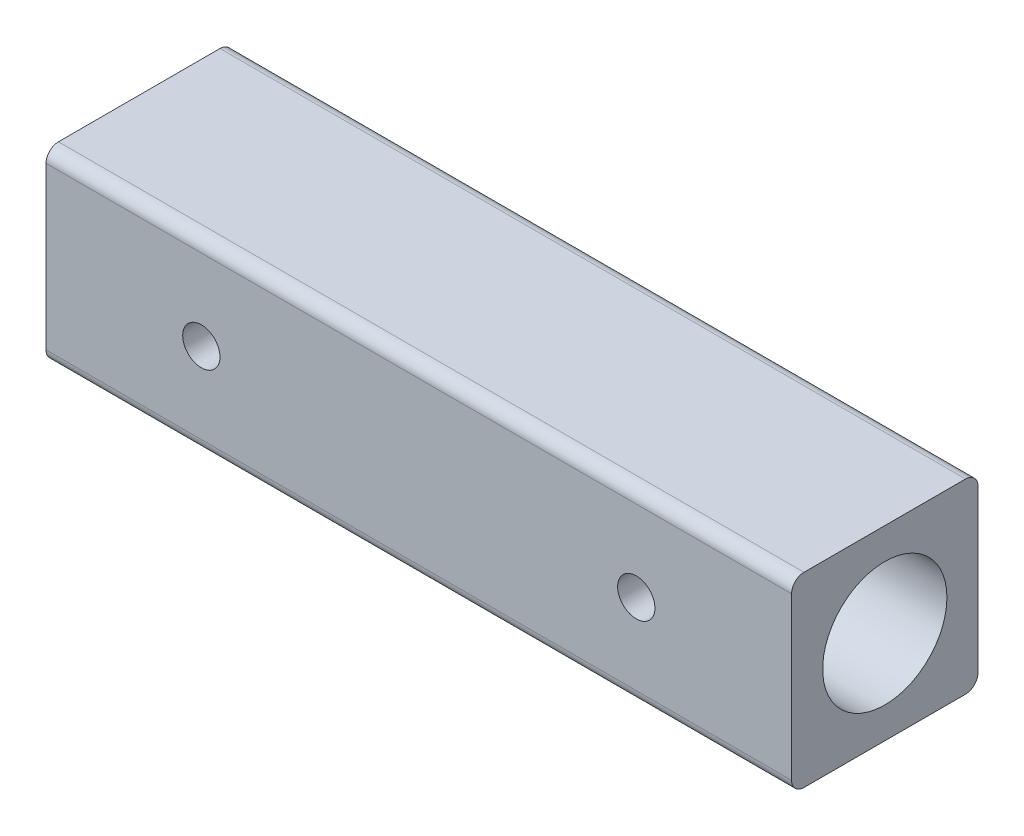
ISO-10303-21;
HEADER;
FILE_DESCRIPTION(('STEP AP214'),'2;1');
FILE_NAME('part.step','',(''),(''),'','','');
FILE_SCHEMA(('AUTOMOTIVE_DESIGN { 1 0 10303 214 1 1 1 1 }'));
ENDSEC;
DATA;
#1=APPLICATION_CONTEXT('core data for automotive mechanical design processes');
#2=APPLICATION_PROTOCOL_DEFINITION('international standard','automotive_design',2000,#1);
#3=PRODUCT_CONTEXT('',#1,'mechanical');
#4=PRODUCT('Part','Part','',(#3));
#5=PRODUCT_RELATED_PRODUCT_CATEGORY('part','',(#4));
#6=PRODUCT_DEFINITION_FORMATION('','',#4);
#7=PRODUCT_DEFINITION_CONTEXT('part definition',#1,'design');
#8=PRODUCT_DEFINITION('design','',#6,#7);
#9=PRODUCT_DEFINITION_SHAPE('','',#8);
#10=(LENGTH_UNIT() NAMED_UNIT(*) SI_UNIT(.MILLI.,.METRE.));
#11=(NAMED_UNIT(*) PLANE_ANGLE_UNIT() SI_UNIT($,.RADIAN.));
#12=(NAMED_UNIT(*) SI_UNIT($,.STERADIAN.) SOLID_ANGLE_UNIT());
#13=UNCERTAINTY_MEASURE_WITH_UNIT(LENGTH_MEASURE(1.E-05),#10,'distance_accuracy_value','');
#14=(GEOMETRIC_REPRESENTATION_CONTEXT(3) GLOBAL_UNCERTAINTY_ASSIGNED_CONTEXT((#13)) GLOBAL_UNIT_ASSIGNED_CONTEXT((#10,
#11,#12)) REPRESENTATION_CONTEXT('',''));
#15=CARTESIAN_POINT('',(0.,0.,0.));
#16=DIRECTION('',(0.,0.,1.));
#17=DIRECTION('',(1.,0.,0.));
#18=AXIS2_PLACEMENT_3D('',#15,#16,#17);
#19=CARTESIAN_POINT('',(40.,0.,0.));
#20=DIRECTION('',(-1.,0.,0.));
#21=DIRECTION('',(0.,0.,1.));
#22=AXIS2_PLACEMENT_3D('',#19,#20,#21);
#23=CYLINDRICAL_SURFACE('',#22,10.);
#24=CARTESIAN_POINT('',(28.,0.,-10.));
#25=CARTESIAN_POINT('',(27.9999980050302,-0.164577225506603,-9.99999858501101));
#26=CARTESIAN_POINT('',(27.9864122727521,-0.329174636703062,-9.99589831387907));
#27=CARTESIAN_POINT('',(27.9325572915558,-0.653576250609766,-9.97994211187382));
#28=CARTESIAN_POINT('',(27.8922800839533,-0.813379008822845,-9.96808386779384));
#29=CARTESIAN_POINT('',(27.7865079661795,-1.12346541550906,-9.93791105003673));
#30=CARTESIAN_POINT('',(27.7210502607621,-1.27376272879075,-9.91960600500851));
#31=CARTESIAN_POINT('',(27.5669278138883,-1.56124836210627,-9.8784421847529));
#32=CARTESIAN_POINT('',(27.4782599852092,-1.69843493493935,-9.85558280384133));
#33=CARTESIAN_POINT('',(27.2775519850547,-1.9597435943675,-9.80701474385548));
#34=CARTESIAN_POINT('',(27.1649667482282,-2.08343614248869,-9.78124767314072));
#35=CARTESIAN_POINT('',(26.9207815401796,-2.31049841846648,-9.73011668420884));
#36=CARTESIAN_POINT('',(26.7891783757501,-2.41386472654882,-9.70475283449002));
#37=CARTESIAN_POINT('',(26.5070584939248,-2.59960075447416,-9.65668227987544));
#38=CARTESIAN_POINT('',(26.3561830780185,-2.68144618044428,-9.63404813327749));
#39=CARTESIAN_POINT('',(26.0420214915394,-2.81842789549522,-9.59487240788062));
#40=CARTESIAN_POINT('',(25.878738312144,-2.87357059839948,-9.57832936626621));
#41=CARTESIAN_POINT('',(25.5492194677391,-2.95403267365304,-9.55381741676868));
#42=CARTESIAN_POINT('',(25.3831945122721,-2.98014392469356,-9.54562138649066));
#43=CARTESIAN_POINT('',(25.0489336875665,-3.00427461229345,-9.53805579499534));
#44=CARTESIAN_POINT('',(24.8806983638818,-3.00230085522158,-9.53868409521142));
#45=CARTESIAN_POINT('',(24.553232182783,-2.97093954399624,-9.54849488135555));
#46=CARTESIAN_POINT('',(24.3938954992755,-2.94254410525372,-9.55736777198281));
#47=CARTESIAN_POINT('',(24.0823604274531,-2.86074840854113,-9.58216712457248));
#48=CARTESIAN_POINT('',(23.9301627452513,-2.80734568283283,-9.59809428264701));
#49=CARTESIAN_POINT('',(23.6347993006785,-2.67632053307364,-9.63545466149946));
#50=CARTESIAN_POINT('',(23.4917858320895,-2.59837633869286,-9.65696032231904));
#51=CARTESIAN_POINT('',(23.2205359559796,-2.42070445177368,-9.70301974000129));
#52=CARTESIAN_POINT('',(23.0923031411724,-2.32097148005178,-9.72757423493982));
#53=CARTESIAN_POINT('',(22.848627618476,-2.09762581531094,-9.77822022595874));
#54=CARTESIAN_POINT('',(22.7339426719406,-1.97318981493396,-9.80433308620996));
#55=CARTESIAN_POINT('',(22.5268920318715,-1.70652651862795,-9.85424488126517));
#56=CARTESIAN_POINT('',(22.4345277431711,-1.56429810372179,-9.8780436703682));
#57=CARTESIAN_POINT('',(22.2742801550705,-1.26471007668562,-9.92086320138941));
#58=CARTESIAN_POINT('',(22.2065649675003,-1.10725549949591,-9.93985087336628));
#59=CARTESIAN_POINT('',(22.0988008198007,-0.782490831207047,-9.97067043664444));
#60=CARTESIAN_POINT('',(22.058744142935,-0.615183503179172,-9.98250432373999));
#61=CARTESIAN_POINT('',(22.0086956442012,-0.281904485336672,-9.99736729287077));
#62=CARTESIAN_POINT('',(21.9976768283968,-0.116100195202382,-10.0006970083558));
#63=CARTESIAN_POINT('',(22.0031383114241,0.21499921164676,-9.99905846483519));
#64=CARTESIAN_POINT('',(22.0196149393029,0.380294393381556,-9.99409131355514));
#65=CARTESIAN_POINT('',(22.078769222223,0.701807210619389,-9.97661393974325));
#66=CARTESIAN_POINT('',(22.1208467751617,0.858145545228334,-9.96427659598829));
#67=CARTESIAN_POINT('',(22.2292864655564,1.16150927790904,-9.9334869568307));
#68=CARTESIAN_POINT('',(22.2956515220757,1.30853355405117,-9.91503392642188));
#69=CARTESIAN_POINT('',(22.4525063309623,1.5928743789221,-9.87339308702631));
#70=CARTESIAN_POINT('',(22.5435186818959,1.72988765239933,-9.8501056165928));
#71=CARTESIAN_POINT('',(22.7464495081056,1.98704661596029,-9.80146937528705));
#72=CARTESIAN_POINT('',(22.8583732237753,2.10718806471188,-9.7761200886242));
#73=CARTESIAN_POINT('',(23.1047746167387,2.33171489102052,-9.72506343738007));
#74=CARTESIAN_POINT('',(23.2399237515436,2.43536962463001,-9.69937650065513));
#75=CARTESIAN_POINT('',(23.5262558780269,2.61857990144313,-9.65153030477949));
#76=CARTESIAN_POINT('',(23.6774384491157,2.69813607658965,-9.62937095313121));
#77=CARTESIAN_POINT('',(23.99106498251,2.83034694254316,-9.5913437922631));
#78=CARTESIAN_POINT('',(24.1534523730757,2.88312693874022,-9.575446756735));
#79=CARTESIAN_POINT('',(24.4853759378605,2.96043461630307,-9.55183188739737));
#80=CARTESIAN_POINT('',(24.6549096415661,2.98497197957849,-9.54411125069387));
#81=CARTESIAN_POINT('',(24.9887230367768,3.0044396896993,-9.53799944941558));
#82=CARTESIAN_POINT('',(25.1529273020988,3.00056110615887,-9.53923294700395));
#83=CARTESIAN_POINT('',(25.4782282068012,2.96615010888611,-9.54998802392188));
#84=CARTESIAN_POINT('',(25.639324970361,2.93561876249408,-9.55950927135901));
#85=CARTESIAN_POINT('',(25.9518907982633,2.84953777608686,-9.58551527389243));
#86=CARTESIAN_POINT('',(26.1034545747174,2.79430351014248,-9.60191209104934));
#87=CARTESIAN_POINT('',(26.3952848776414,2.66063014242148,-9.63980557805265));
#88=CARTESIAN_POINT('',(26.5355492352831,2.58218659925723,-9.6613032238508));
#89=CARTESIAN_POINT('',(26.8063262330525,2.40097527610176,-9.70795352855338));
#90=CARTESIAN_POINT('',(26.9362975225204,2.29742552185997,-9.7332108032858));
#91=CARTESIAN_POINT('',(27.1774049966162,2.07034869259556,-9.78402640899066));
#92=CARTESIAN_POINT('',(27.2885362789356,1.94681643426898,-9.80958481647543));
#93=CARTESIAN_POINT('',(27.4920468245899,1.67893152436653,-9.85901873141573));
#94=CARTESIAN_POINT('',(27.5837828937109,1.53407577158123,-9.88282319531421));
#95=CARTESIAN_POINT('',(27.7414703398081,1.23028274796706,-9.92521360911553));
#96=CARTESIAN_POINT('',(27.807433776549,1.07135210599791,-9.94380199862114));
#97=CARTESIAN_POINT('',(27.9057905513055,0.761515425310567,-9.97204349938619));
#98=CARTESIAN_POINT('',(27.9410233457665,0.611573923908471,-9.9824405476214));
#99=CARTESIAN_POINT('',(27.9881270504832,0.307760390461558,-9.9964188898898));
#100=CARTESIAN_POINT('',(28.0000018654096,0.153889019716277,-10.0000013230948));
#101=CARTESIAN_POINT('',(28.,0.,-10.));
#102=B_SPLINE_CURVE_WITH_KNOTS('',3,(#24,#25,#26,#27,#28,#29,#30,#31,#32,#33,#34,#35,#36,#37,
#38,#39,#40,#41,#42,#43,#44,#45,#46,#47,#48,#49,#50,#51,#52,#53,#54,#55,#56,#57,#58,#59,#60,#61,
#62,#63,#64,#65,#66,#67,#68,#69,#70,#71,#72,#73,#74,#75,#76,#77,#78,#79,#80,#81,#82,#83,#84,#85,
#86,#87,#88,#89,#90,#91,#92,#93,#94,#95,#96,#97,#98,#99,#100,#101),.UNSPECIFIED.,.T.,.F.,(4,2,2,
2,2,2,2,2,2,2,2,2,2,2,2,2,2,2,2,2,2,2,2,2,2,2,2,2,2,2,2,2,2,2,2,2,2,2,4),(0.,0.493166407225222,
0.986479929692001,1.47906735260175,1.97172032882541,2.47711205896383,2.98258874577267,
3.49942962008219,4.01614629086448,4.51839378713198,5.02051956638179,5.50452033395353,
5.98856887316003,6.4792485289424,6.97004720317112,7.48134208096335,7.99266913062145,
8.50742093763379,9.02202907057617,9.51817618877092,10.0142570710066,10.4991349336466,
10.9840710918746,11.4802261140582,11.9765056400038,12.4908080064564,13.0050968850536,
13.5169562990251,14.0286401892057,14.5190031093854,15.0093463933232,15.4936008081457,
15.9779479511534,16.4799385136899,16.9820594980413,17.4988599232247,18.0154182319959,
18.4766338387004,18.9377723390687),.UNSPECIFIED.);
#103=CARTESIAN_POINT('',(28.,0.,-10.));
#104=VERTEX_POINT('',#103);
#105=EDGE_CURVE('E187',#104,#104,#102,.T.);
#106=ORIENTED_EDGE('',*,*,#105,.T.);
#107=EDGE_LOOP('',(#106));
#108=FACE_BOUND('',#107,.T.);
#109=CARTESIAN_POINT('',(40.,0.,0.));
#110=DIRECTION('',(1.,0.,0.));
#111=DIRECTION('',(0.,0.,-1.));
#112=AXIS2_PLACEMENT_3D('',#109,#110,#111);
#113=CIRCLE('',#112,10.);
#114=CARTESIAN_POINT('',(40.,0.,-10.));
#115=VERTEX_POINT('',#114);
#116=EDGE_CURVE('E152',#115,#115,#113,.T.);
#117=ORIENTED_EDGE('',*,*,#116,.T.);
#118=EDGE_LOOP('',(#117));
#119=FACE_BOUND('',#118,.T.);
#120=CARTESIAN_POINT('',(0.,0.,0.));
#121=DIRECTION('',(1.,0.,0.));
#122=DIRECTION('',(0.,0.,-1.));
#123=AXIS2_PLACEMENT_3D('',#120,#121,#122);
#124=CIRCLE('',#123,10.);
#125=CARTESIAN_POINT('',(0.,0.,-10.));
#126=VERTEX_POINT('',#125);
#127=EDGE_CURVE('E194',#126,#126,#124,.T.);
#128=ORIENTED_EDGE('',*,*,#127,.F.);
#129=EDGE_LOOP('',(#128));
#130=FACE_BOUND('',#129,.T.);
#131=CARTESIAN_POINT('',(28.,0.,10.));
#132=CARTESIAN_POINT('',(27.9999980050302,0.1645772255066,9.99999858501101));
#133=CARTESIAN_POINT('',(27.9864122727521,0.32917463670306,9.99589831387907));
#134=CARTESIAN_POINT('',(27.9325572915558,0.653576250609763,9.97994211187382));
#135=CARTESIAN_POINT('',(27.8922800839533,0.813379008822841,9.96808386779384));
#136=CARTESIAN_POINT('',(27.7865079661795,1.12346541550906,9.93791105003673));
#137=CARTESIAN_POINT('',(27.7210502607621,1.27376272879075,9.91960600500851));
#138=CARTESIAN_POINT('',(27.5669278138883,1.56124836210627,9.8784421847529));
#139=CARTESIAN_POINT('',(27.4782599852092,1.69843493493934,9.85558280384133));
#140=CARTESIAN_POINT('',(27.2775519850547,1.95974359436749,9.80701474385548));
#141=CARTESIAN_POINT('',(27.1649667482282,2.08343614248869,9.78124767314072));
#142=CARTESIAN_POINT('',(26.9207815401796,2.31049841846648,9.73011668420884));
#143=CARTESIAN_POINT('',(26.7891783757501,2.41386472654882,9.70475283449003));
#144=CARTESIAN_POINT('',(26.5070584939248,2.59960075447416,9.65668227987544));
#145=CARTESIAN_POINT('',(26.3561830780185,2.68144618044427,9.63404813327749));
#146=CARTESIAN_POINT('',(26.0420214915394,2.81842789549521,9.59487240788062));
#147=CARTESIAN_POINT('',(25.878738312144,2.87357059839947,9.57832936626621));
#148=CARTESIAN_POINT('',(25.5492194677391,2.95403267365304,9.55381741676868));
#149=CARTESIAN_POINT('',(25.3831945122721,2.98014392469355,9.54562138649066));
#150=CARTESIAN_POINT('',(25.0489336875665,3.00427461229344,9.53805579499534));
#151=CARTESIAN_POINT('',(24.8806983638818,3.00230085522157,9.53868409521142));
#152=CARTESIAN_POINT('',(24.553232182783,2.97093954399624,9.54849488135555));
#153=CARTESIAN_POINT('',(24.3938954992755,2.94254410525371,9.55736777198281));
#154=CARTESIAN_POINT('',(24.0823604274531,2.86074840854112,9.58216712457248));
#155=CARTESIAN_POINT('',(23.9301627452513,2.80734568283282,9.59809428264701));
#156=CARTESIAN_POINT('',(23.6347993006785,2.67632053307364,9.63545466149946));
#157=CARTESIAN_POINT('',(23.4917858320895,2.59837633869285,9.65696032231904));
#158=CARTESIAN_POINT('',(23.2205359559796,2.42070445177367,9.70301974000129));
#159=CARTESIAN_POINT('',(23.0923031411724,2.32097148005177,9.72757423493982));
#160=CARTESIAN_POINT('',(22.8486276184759,2.09762581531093,9.77822022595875));
#161=CARTESIAN_POINT('',(22.7339426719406,1.97318981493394,9.80433308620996));
#162=CARTESIAN_POINT('',(22.5268920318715,1.70652651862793,9.85424488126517));
#163=CARTESIAN_POINT('',(22.4345277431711,1.56429810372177,9.8780436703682));
#164=CARTESIAN_POINT('',(22.2742801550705,1.2647100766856,9.92086320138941));
#165=CARTESIAN_POINT('',(22.2065649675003,1.1072554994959,9.93985087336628));
#166=CARTESIAN_POINT('',(22.0988008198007,0.782490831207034,9.97067043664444));
#167=CARTESIAN_POINT('',(22.058744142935,0.615183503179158,9.98250432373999));
#168=CARTESIAN_POINT('',(22.0086956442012,0.281904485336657,9.99736729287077));
#169=CARTESIAN_POINT('',(21.9976768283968,0.116100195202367,10.0006970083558));
#170=CARTESIAN_POINT('',(22.0031383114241,-0.214999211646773,9.99905846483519));
#171=CARTESIAN_POINT('',(22.0196149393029,-0.380294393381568,9.99409131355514));
#172=CARTESIAN_POINT('',(22.078769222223,-0.7018072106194,9.97661393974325));
#173=CARTESIAN_POINT('',(22.1208467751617,-0.858145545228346,9.96427659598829));
#174=CARTESIAN_POINT('',(22.2292864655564,-1.16150927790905,9.9334869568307));
#175=CARTESIAN_POINT('',(22.2956515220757,-1.30853355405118,9.91503392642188));
#176=CARTESIAN_POINT('',(22.4525063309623,-1.59287437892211,9.87339308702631));
#177=CARTESIAN_POINT('',(22.5435186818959,-1.72988765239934,9.8501056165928));
#178=CARTESIAN_POINT('',(22.7464495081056,-1.98704661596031,9.80146937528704));
#179=CARTESIAN_POINT('',(22.8583732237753,-2.10718806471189,9.77612008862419));
#180=CARTESIAN_POINT('',(23.1047746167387,-2.33171489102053,9.72506343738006));
#181=CARTESIAN_POINT('',(23.2399237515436,-2.43536962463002,9.69937650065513));
#182=CARTESIAN_POINT('',(23.5262558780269,-2.61857990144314,9.65153030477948));
#183=CARTESIAN_POINT('',(23.6774384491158,-2.69813607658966,9.62937095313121));
#184=CARTESIAN_POINT('',(23.99106498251,-2.83034694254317,9.59134379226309));
#185=CARTESIAN_POINT('',(24.1534523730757,-2.88312693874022,9.575446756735));
#186=CARTESIAN_POINT('',(24.4853759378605,-2.96043461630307,9.55183188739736));
#187=CARTESIAN_POINT('',(24.6549096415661,-2.9849719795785,9.54411125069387));
#188=CARTESIAN_POINT('',(24.9887230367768,-3.00443968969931,9.53799944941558));
#189=CARTESIAN_POINT('',(25.1529273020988,-3.00056110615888,9.53923294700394));
#190=CARTESIAN_POINT('',(25.4782282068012,-2.96615010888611,9.54998802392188));
#191=CARTESIAN_POINT('',(25.639324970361,-2.93561876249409,9.55950927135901));
#192=CARTESIAN_POINT('',(25.9518907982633,-2.84953777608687,9.58551527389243));
#193=CARTESIAN_POINT('',(26.1034545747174,-2.79430351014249,9.60191209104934));
#194=CARTESIAN_POINT('',(26.3952848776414,-2.66063014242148,9.63980557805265));
#195=CARTESIAN_POINT('',(26.5355492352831,-2.58218659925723,9.6613032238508));
#196=CARTESIAN_POINT('',(26.8063262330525,-2.40097527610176,9.70795352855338));
#197=CARTESIAN_POINT('',(26.9362975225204,-2.29742552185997,9.7332108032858));
#198=CARTESIAN_POINT('',(27.1774049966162,-2.07034869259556,9.78402640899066));
#199=CARTESIAN_POINT('',(27.2885362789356,-1.94681643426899,9.80958481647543));
#200=CARTESIAN_POINT('',(27.4920468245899,-1.67893152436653,9.85901873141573));
#201=CARTESIAN_POINT('',(27.5837828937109,-1.53407577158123,9.88282319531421));
#202=CARTESIAN_POINT('',(27.7414703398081,-1.23028274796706,9.92521360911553));
#203=CARTESIAN_POINT('',(27.807433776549,-1.07135210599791,9.94380199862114));
#204=CARTESIAN_POINT('',(27.9057905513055,-0.761515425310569,9.97204349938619));
#205=CARTESIAN_POINT('',(27.9410233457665,-0.611573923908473,9.9824405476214));
#206=CARTESIAN_POINT('',(27.9881270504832,-0.307760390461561,9.9964188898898));
#207=CARTESIAN_POINT('',(28.0000018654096,-0.15388901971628,10.0000013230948));
#208=CARTESIAN_POINT('',(28.,0.,10.));
#209=B_SPLINE_CURVE_WITH_KNOTS('',3,(#131,#132,#133,#134,#135,#136,#137,#138,#139,#140,#141,
#142,#143,#144,#145,#146,#147,#148,#149,#150,#151,#152,#153,#154,#155,#156,#157,#158,#159,#160,
#161,#162,#163,#164,#165,#166,#167,#168,#169,#170,#171,#172,#173,#174,#175,#176,#177,#178,#179,
#180,#181,#182,#183,#184,#185,#186,#187,#188,#189,#190,#191,#192,#193,#194,#195,#196,#197,#198,
#199,#200,#201,#202,#203,#204,#205,#206,#207,#208),.UNSPECIFIED.,.T.,.F.,(4,2,2,2,2,2,2,2,2,2,2,
2,2,2,2,2,2,2,2,2,2,2,2,2,2,2,2,2,2,2,2,2,2,2,2,2,2,2,4),(0.,0.493166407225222,
0.986479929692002,1.47906735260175,1.97172032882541,2.47711205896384,2.98258874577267,
3.49942962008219,4.01614629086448,4.51839378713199,5.0205195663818,5.50452033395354,
5.98856887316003,6.4792485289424,6.97004720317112,7.48134208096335,7.99266913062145,
8.50742093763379,9.02202907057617,9.51817618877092,10.0142570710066,10.4991349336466,
10.9840710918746,11.4802261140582,11.9765056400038,12.4908080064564,13.0050968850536,
13.5169562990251,14.0286401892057,14.5190031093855,15.0093463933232,15.4936008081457,
15.9779479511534,16.4799385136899,16.9820594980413,17.4988599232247,18.0154182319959,
18.4766338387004,18.9377723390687),.UNSPECIFIED.);
#210=CARTESIAN_POINT('',(28.,0.,10.));
#211=VERTEX_POINT('',#210);
#212=EDGE_CURVE('E38',#211,#211,#209,.T.);
#213=ORIENTED_EDGE('',*,*,#212,.T.);
#214=EDGE_LOOP('',(#213));
#215=FACE_BOUND('',#214,.T.);
#216=ADVANCED_FACE('F34',(#108,#119,#130,#215),#23,.F.);
#217=CARTESIAN_POINT('',(120.,-15.,15.));
#218=DIRECTION('',(0.,0.,-1.));
#219=DIRECTION('',(-1.,0.,0.));
#220=AXIS2_PLACEMENT_3D('',#217,#218,#219);
#221=PLANE('',#220);
#222=CARTESIAN_POINT('',(25.,0.,15.));
#223=DIRECTION('',(0.,0.,-1.));
#224=DIRECTION('',(-1.,0.,0.));
#225=AXIS2_PLACEMENT_3D('',#222,#223,#224);
#226=CIRCLE('',#225,3.00000000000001);
#227=CARTESIAN_POINT('',(22.,0.,15.));
#228=VERTEX_POINT('',#227);
#229=EDGE_CURVE('E200',#228,#228,#226,.F.);
#230=ORIENTED_EDGE('',*,*,#229,.F.);
#231=EDGE_LOOP('',(#230));
#232=FACE_BOUND('',#231,.T.);
#233=CARTESIAN_POINT('',(95.,0.,15.));
#234=DIRECTION('',(0.,0.,-1.));
#235=DIRECTION('',(-1.,0.,0.));
#236=AXIS2_PLACEMENT_3D('',#233,#234,#235);
#237=CIRCLE('',#236,3.00000000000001);
#238=CARTESIAN_POINT('',(92.,0.,15.));
#239=VERTEX_POINT('',#238);
#240=EDGE_CURVE('E227',#239,#239,#237,.T.);
#241=ORIENTED_EDGE('',*,*,#240,.T.);
#242=EDGE_LOOP('',(#241));
#243=FACE_BOUND('',#242,.T.);
#244=DIRECTION('',(0.,-1.,0.));
#245=VECTOR('',#244,1.);
#246=CARTESIAN_POINT('',(0.,-15.,15.));
#247=LINE('',#246,#245);
#248=CARTESIAN_POINT('',(0.,13.,15.));
#249=VERTEX_POINT('',#248);
#250=CARTESIAN_POINT('',(0.,-13.,15.));
#251=VERTEX_POINT('',#250);
#252=EDGE_CURVE('E133',#249,#251,#247,.T.);
#253=ORIENTED_EDGE('',*,*,#252,.T.);
#254=DIRECTION('',(-1.,0.,0.));
#255=VECTOR('',#254,1.);
#256=CARTESIAN_POINT('',(120.,-13.,15.));
#257=LINE('',#256,#255);
#258=CARTESIAN_POINT('',(120.,-13.,15.));
#259=VERTEX_POINT('',#258);
#260=EDGE_CURVE('E111',#251,#259,#257,.F.);
#261=ORIENTED_EDGE('',*,*,#260,.T.);
#262=DIRECTION('',(0.,-1.,0.));
#263=VECTOR('',#262,1.);
#264=CARTESIAN_POINT('',(120.,-15.,15.));
#265=LINE('',#264,#263);
#266=CARTESIAN_POINT('',(120.,13.,15.));
#267=VERTEX_POINT('',#266);
#268=EDGE_CURVE('E143',#267,#259,#265,.T.);
#269=ORIENTED_EDGE('',*,*,#268,.F.);
#270=DIRECTION('',(-1.,0.,0.));
#271=VECTOR('',#270,1.);
#272=CARTESIAN_POINT('',(120.,13.,15.));
#273=LINE('',#272,#271);
#274=EDGE_CURVE('E116',#267,#249,#273,.T.);
#275=ORIENTED_EDGE('',*,*,#274,.T.);
#276=EDGE_LOOP('',(#253,#261,#269,#275));
#277=FACE_BOUND('',#276,.T.);
#278=ADVANCED_FACE('F177',(#232,#243,#277),#221,.F.);
#279=CARTESIAN_POINT('',(120.,-15.,-15.));
#280=DIRECTION('',(0.,1.,0.));
#281=DIRECTION('',(0.,0.,1.));
#282=AXIS2_PLACEMENT_3D('',#279,#280,#281);
#283=PLANE('',#282);
#284=DIRECTION('',(0.,0.,-1.));
#285=VECTOR('',#284,1.);
#286=CARTESIAN_POINT('',(120.,-15.,-15.));
#287=LINE('',#286,#285);
#288=CARTESIAN_POINT('',(120.,-15.,13.));
#289=VERTEX_POINT('',#288);
#290=CARTESIAN_POINT('',(120.,-15.,-13.));
#291=VERTEX_POINT('',#290);
#292=EDGE_CURVE('E126',#289,#291,#287,.T.);
#293=ORIENTED_EDGE('',*,*,#292,.F.);
#294=DIRECTION('',(-1.,0.,0.));
#295=VECTOR('',#294,1.);
#296=CARTESIAN_POINT('',(120.,-15.,13.));
#297=LINE('',#296,#295);
#298=CARTESIAN_POINT('',(0.,-15.,13.));
#299=VERTEX_POINT('',#298);
#300=EDGE_CURVE('E110',#289,#299,#297,.T.);
#301=ORIENTED_EDGE('',*,*,#300,.T.);
#302=DIRECTION('',(0.,0.,-1.));
#303=VECTOR('',#302,1.);
#304=CARTESIAN_POINT('',(0.,-15.,-15.));
#305=LINE('',#304,#303);
#306=CARTESIAN_POINT('',(0.,-15.,-13.));
#307=VERTEX_POINT('',#306);
#308=EDGE_CURVE('E123',#299,#307,#305,.T.);
#309=ORIENTED_EDGE('',*,*,#308,.T.);
#310=DIRECTION('',(-1.,0.,0.));
#311=VECTOR('',#310,1.);
#312=CARTESIAN_POINT('',(120.,-15.,-13.));
#313=LINE('',#312,#311);
#314=EDGE_CURVE('E128',#307,#291,#313,.F.);
#315=ORIENTED_EDGE('',*,*,#314,.T.);
#316=EDGE_LOOP('',(#293,#301,#309,#315));
#317=FACE_BOUND('',#316,.T.);
#318=ADVANCED_FACE('F122',(#317),#283,.F.);
#319=CARTESIAN_POINT('',(120.,-15.,-15.));
#320=DIRECTION('',(0.,0.,1.));
#321=DIRECTION('',(1.,0.,0.));
#322=AXIS2_PLACEMENT_3D('',#319,#320,#321);
#323=PLANE('',#322);
#324=CARTESIAN_POINT('',(25.,0.,-15.));
#325=DIRECTION('',(0.,0.,1.));
#326=DIRECTION('',(1.,0.,0.));
#327=AXIS2_PLACEMENT_3D('',#324,#325,#326);
#328=CIRCLE('',#327,3.00000000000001);
#329=CARTESIAN_POINT('',(28.,0.,-15.));
#330=VERTEX_POINT('',#329);
#331=EDGE_CURVE('E198',#330,#330,#328,.F.);
#332=ORIENTED_EDGE('',*,*,#331,.F.);
#333=EDGE_LOOP('',(#332));
#334=FACE_BOUND('',#333,.T.);
#335=CARTESIAN_POINT('',(95.,0.,-15.));
#336=DIRECTION('',(0.,0.,1.));
#337=DIRECTION('',(1.,0.,0.));
#338=AXIS2_PLACEMENT_3D('',#335,#336,#337);
#339=CIRCLE('',#338,3.00000000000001);
#340=CARTESIAN_POINT('',(98.,0.,-15.));
#341=VERTEX_POINT('',#340);
#342=EDGE_CURVE('E224',#341,#341,#339,.T.);
#343=ORIENTED_EDGE('',*,*,#342,.T.);
#344=EDGE_LOOP('',(#343));
#345=FACE_BOUND('',#344,.T.);
#346=DIRECTION('',(0.,1.,0.));
#347=VECTOR('',#346,1.);
#348=CARTESIAN_POINT('',(120.,-15.,-15.));
#349=LINE('',#348,#347);
#350=CARTESIAN_POINT('',(120.,-13.,-15.));
#351=VERTEX_POINT('',#350);
#352=CARTESIAN_POINT('',(120.,13.,-15.));
#353=VERTEX_POINT('',#352);
#354=EDGE_CURVE('E237',#351,#353,#349,.T.);
#355=ORIENTED_EDGE('',*,*,#354,.F.);
#356=DIRECTION('',(-1.,0.,0.));
#357=VECTOR('',#356,1.);
#358=CARTESIAN_POINT('',(120.,-13.,-15.));
#359=LINE('',#358,#357);
#360=CARTESIAN_POINT('',(0.,-13.,-15.));
#361=VERTEX_POINT('',#360);
#362=EDGE_CURVE('E257',#351,#361,#359,.T.);
#363=ORIENTED_EDGE('',*,*,#362,.T.);
#364=DIRECTION('',(0.,1.,0.));
#365=VECTOR('',#364,1.);
#366=CARTESIAN_POINT('',(0.,-15.,-15.));
#367=LINE('',#366,#365);
#368=CARTESIAN_POINT('',(0.,13.,-15.));
#369=VERTEX_POINT('',#368);
#370=EDGE_CURVE('E132',#361,#369,#367,.T.);
#371=ORIENTED_EDGE('',*,*,#370,.T.);
#372=DIRECTION('',(-1.,0.,0.));
#373=VECTOR('',#372,1.);
#374=CARTESIAN_POINT('',(120.,13.,-15.));
#375=LINE('',#374,#373);
#376=EDGE_CURVE('E255',#369,#353,#375,.F.);
#377=ORIENTED_EDGE('',*,*,#376,.T.);
#378=EDGE_LOOP('',(#355,#363,#371,#377));
#379=FACE_BOUND('',#378,.T.);
#380=ADVANCED_FACE('F262',(#334,#345,#379),#323,.F.);
#381=CARTESIAN_POINT('',(120.,15.,-15.));
#382=DIRECTION('',(0.,-1.,0.));
#383=DIRECTION('',(0.,0.,-1.));
#384=AXIS2_PLACEMENT_3D('',#381,#382,#383);
#385=PLANE('',#384);
#386=DIRECTION('',(0.,0.,1.));
#387=VECTOR('',#386,1.);
#388=CARTESIAN_POINT('',(120.,15.,-15.));
#389=LINE('',#388,#387);
#390=CARTESIAN_POINT('',(120.,15.,-13.));
#391=VERTEX_POINT('',#390);
#392=CARTESIAN_POINT('',(120.,15.,13.));
#393=VERTEX_POINT('',#392);
#394=EDGE_CURVE('E238',#391,#393,#389,.T.);
#395=ORIENTED_EDGE('',*,*,#394,.F.);
#396=DIRECTION('',(-1.,0.,0.));
#397=VECTOR('',#396,1.);
#398=CARTESIAN_POINT('',(120.,15.,-13.));
#399=LINE('',#398,#397);
#400=CARTESIAN_POINT('',(0.,15.,-13.));
#401=VERTEX_POINT('',#400);
#402=EDGE_CURVE('E11',#391,#401,#399,.T.);
#403=ORIENTED_EDGE('',*,*,#402,.T.);
#404=DIRECTION('',(0.,0.,1.));
#405=VECTOR('',#404,1.);
#406=CARTESIAN_POINT('',(0.,15.,-15.));
#407=LINE('',#406,#405);
#408=CARTESIAN_POINT('',(0.,15.,13.));
#409=VERTEX_POINT('',#408);
#410=EDGE_CURVE('E136',#401,#409,#407,.T.);
#411=ORIENTED_EDGE('',*,*,#410,.T.);
#412=DIRECTION('',(-1.,0.,0.));
#413=VECTOR('',#412,1.);
#414=CARTESIAN_POINT('',(120.,15.,13.));
#415=LINE('',#414,#413);
#416=EDGE_CURVE('E47',#409,#393,#415,.F.);
#417=ORIENTED_EDGE('',*,*,#416,.T.);
#418=EDGE_LOOP('',(#395,#403,#411,#417));
#419=FACE_BOUND('',#418,.T.);
#420=ADVANCED_FACE('F269',(#419),#385,.F.);
#421=CARTESIAN_POINT('',(120.,0.,0.));
#422=DIRECTION('',(1.,0.,0.));
#423=DIRECTION('',(0.,0.,-1.));
#424=AXIS2_PLACEMENT_3D('',#421,#422,#423);
#425=PLANE('',#424);
#426=CARTESIAN_POINT('',(120.,0.,0.));
#427=DIRECTION('',(1.,0.,0.));
#428=DIRECTION('',(0.,0.,-1.));
#429=AXIS2_PLACEMENT_3D('',#426,#427,#428);
#430=CIRCLE('',#429,10.);
#431=CARTESIAN_POINT('',(120.,0.,-10.));
#432=VERTEX_POINT('',#431);
#433=EDGE_CURVE('E230',#432,#432,#430,.T.);
#434=ORIENTED_EDGE('',*,*,#433,.F.);
#435=EDGE_LOOP('',(#434));
#436=FACE_BOUND('',#435,.T.);
#437=ORIENTED_EDGE('',*,*,#268,.T.);
#438=CARTESIAN_POINT('',(120.,-13.,13.));
#439=DIRECTION('',(1.,0.,0.));
#440=DIRECTION('',(0.,0.,-1.));
#441=AXIS2_PLACEMENT_3D('',#438,#439,#440);
#442=CIRCLE('',#441,2.);
#443=EDGE_CURVE('E253',#259,#289,#442,.T.);
#444=ORIENTED_EDGE('',*,*,#443,.T.);
#445=ORIENTED_EDGE('',*,*,#292,.T.);
#446=CARTESIAN_POINT('',(120.,-13.,-13.));
#447=DIRECTION('',(1.,0.,0.));
#448=DIRECTION('',(0.,0.,-1.));
#449=AXIS2_PLACEMENT_3D('',#446,#447,#448);
#450=CIRCLE('',#449,2.);
#451=EDGE_CURVE('E251',#291,#351,#450,.T.);
#452=ORIENTED_EDGE('',*,*,#451,.T.);
#453=ORIENTED_EDGE('',*,*,#354,.T.);
#454=CARTESIAN_POINT('',(120.,13.,-13.));
#455=DIRECTION('',(1.,0.,0.));
#456=DIRECTION('',(0.,0.,-1.));
#457=AXIS2_PLACEMENT_3D('',#454,#455,#456);
#458=CIRCLE('',#457,2.);
#459=EDGE_CURVE('E61',#353,#391,#458,.T.);
#460=ORIENTED_EDGE('',*,*,#459,.T.);
#461=ORIENTED_EDGE('',*,*,#394,.T.);
#462=CARTESIAN_POINT('',(120.,13.,13.));
#463=DIRECTION('',(1.,0.,0.));
#464=DIRECTION('',(0.,0.,-1.));
#465=AXIS2_PLACEMENT_3D('',#462,#463,#464);
#466=CIRCLE('',#465,2.);
#467=EDGE_CURVE('E248',#393,#267,#466,.T.);
#468=ORIENTED_EDGE('',*,*,#467,.T.);
#469=EDGE_LOOP('',(#437,#444,#445,#452,#453,#460,#461,#468));
#470=FACE_BOUND('',#469,.T.);
#471=ADVANCED_FACE('F272',(#436,#470),#425,.T.);
#472=CARTESIAN_POINT('',(0.,0.,0.));
#473=DIRECTION('',(1.,0.,0.));
#474=DIRECTION('',(0.,0.,-1.));
#475=AXIS2_PLACEMENT_3D('',#472,#473,#474);
#476=PLANE('',#475);
#477=ORIENTED_EDGE('',*,*,#127,.T.);
#478=EDGE_LOOP('',(#477));
#479=FACE_BOUND('',#478,.T.);
#480=ORIENTED_EDGE('',*,*,#308,.F.);
#481=CARTESIAN_POINT('',(0.,-13.,13.));
#482=DIRECTION('',(1.,0.,0.));
#483=DIRECTION('',(0.,0.,-1.));
#484=AXIS2_PLACEMENT_3D('',#481,#482,#483);
#485=CIRCLE('',#484,2.);
#486=EDGE_CURVE('E106',#299,#251,#485,.F.);
#487=ORIENTED_EDGE('',*,*,#486,.T.);
#488=ORIENTED_EDGE('',*,*,#252,.F.);
#489=CARTESIAN_POINT('',(0.,13.,13.));
#490=DIRECTION('',(1.,0.,0.));
#491=DIRECTION('',(0.,0.,-1.));
#492=AXIS2_PLACEMENT_3D('',#489,#490,#491);
#493=CIRCLE('',#492,2.);
#494=EDGE_CURVE('E127',#249,#409,#493,.F.);
#495=ORIENTED_EDGE('',*,*,#494,.T.);
#496=ORIENTED_EDGE('',*,*,#410,.F.);
#497=CARTESIAN_POINT('',(0.,13.,-13.));
#498=DIRECTION('',(1.,0.,0.));
#499=DIRECTION('',(0.,0.,-1.));
#500=AXIS2_PLACEMENT_3D('',#497,#498,#499);
#501=CIRCLE('',#500,2.);
#502=EDGE_CURVE('E242',#401,#369,#501,.F.);
#503=ORIENTED_EDGE('',*,*,#502,.T.);
#504=ORIENTED_EDGE('',*,*,#370,.F.);
#505=CARTESIAN_POINT('',(0.,-13.,-13.));
#506=DIRECTION('',(1.,0.,0.));
#507=DIRECTION('',(0.,0.,-1.));
#508=AXIS2_PLACEMENT_3D('',#505,#506,#507);
#509=CIRCLE('',#508,2.);
#510=EDGE_CURVE('E117',#361,#307,#509,.F.);
#511=ORIENTED_EDGE('',*,*,#510,.T.);
#512=EDGE_LOOP('',(#480,#487,#488,#495,#496,#503,#504,#511));
#513=FACE_BOUND('',#512,.T.);
#514=ADVANCED_FACE('F130',(#479,#513),#476,.F.);
#515=CARTESIAN_POINT('',(80.,0.,0.));
#516=DIRECTION('',(1.,0.,0.));
#517=DIRECTION('',(0.,0.,-1.));
#518=AXIS2_PLACEMENT_3D('',#515,#516,#517);
#519=CYLINDRICAL_SURFACE('',#518,10.);
#520=CARTESIAN_POINT('',(92.,0.,-10.));
#521=CARTESIAN_POINT('',(92.0000019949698,0.164577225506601,-9.999998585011));
#522=CARTESIAN_POINT('',(92.0135877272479,0.329174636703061,-9.99589831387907));
#523=CARTESIAN_POINT('',(92.0674427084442,0.653576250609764,-9.97994211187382));
#524=CARTESIAN_POINT('',(92.1077199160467,0.813379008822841,-9.96808386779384));
#525=CARTESIAN_POINT('',(92.2134920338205,1.12346541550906,-9.93791105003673));
#526=CARTESIAN_POINT('',(92.2789497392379,1.27376272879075,-9.91960600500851));
#527=CARTESIAN_POINT('',(92.4330721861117,1.56124836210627,-9.8784421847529));
#528=CARTESIAN_POINT('',(92.5217400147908,1.69843493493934,-9.85558280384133));
#529=CARTESIAN_POINT('',(92.7224480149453,1.95974359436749,-9.80701474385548));
#530=CARTESIAN_POINT('',(92.8350332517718,2.08343614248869,-9.78124767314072));
#531=CARTESIAN_POINT('',(93.0792184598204,2.31049841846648,-9.73011668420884));
#532=CARTESIAN_POINT('',(93.2108216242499,2.41386472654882,-9.70475283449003));
#533=CARTESIAN_POINT('',(93.4929415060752,2.59960075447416,-9.65668227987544));
#534=CARTESIAN_POINT('',(93.6438169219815,2.68144618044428,-9.63404813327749));
#535=CARTESIAN_POINT('',(93.9579785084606,2.81842789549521,-9.59487240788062));
#536=CARTESIAN_POINT('',(94.1212616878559,2.87357059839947,-9.57832936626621));
#537=CARTESIAN_POINT('',(94.4507805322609,2.95403267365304,-9.55381741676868));
#538=CARTESIAN_POINT('',(94.6168054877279,2.98014392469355,-9.54562138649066));
#539=CARTESIAN_POINT('',(94.9510663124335,3.00427461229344,-9.53805579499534));
#540=CARTESIAN_POINT('',(95.1193016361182,3.00230085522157,-9.53868409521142));
#541=CARTESIAN_POINT('',(95.446767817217,2.97093954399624,-9.54849488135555));
#542=CARTESIAN_POINT('',(95.6061045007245,2.94254410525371,-9.55736777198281));
#543=CARTESIAN_POINT('',(95.9176395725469,2.86074840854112,-9.58216712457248));
#544=CARTESIAN_POINT('',(96.0698372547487,2.80734568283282,-9.59809428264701));
#545=CARTESIAN_POINT('',(96.3652006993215,2.67632053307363,-9.63545466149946));
#546=CARTESIAN_POINT('',(96.5082141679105,2.59837633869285,-9.65696032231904));
#547=CARTESIAN_POINT('',(96.7794640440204,2.42070445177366,-9.70301974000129));
#548=CARTESIAN_POINT('',(96.9076968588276,2.32097148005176,-9.72757423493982));
#549=CARTESIAN_POINT('',(97.1513723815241,2.09762581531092,-9.77822022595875));
#550=CARTESIAN_POINT('',(97.2660573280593,1.97318981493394,-9.80433308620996));
#551=CARTESIAN_POINT('',(97.4731079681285,1.70652651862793,-9.85424488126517));
#552=CARTESIAN_POINT('',(97.5654722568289,1.56429810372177,-9.8780436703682));
#553=CARTESIAN_POINT('',(97.7257198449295,1.2647100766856,-9.92086320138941));
#554=CARTESIAN_POINT('',(97.7934350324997,1.10725549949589,-9.93985087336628));
#555=CARTESIAN_POINT('',(97.9011991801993,0.782490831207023,-9.97067043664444));
#556=CARTESIAN_POINT('',(97.941255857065,0.615183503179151,-9.98250432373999));
#557=CARTESIAN_POINT('',(97.9913043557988,0.281904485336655,-9.99736729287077));
#558=CARTESIAN_POINT('',(98.0023231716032,0.116100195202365,-10.0006970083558));
#559=CARTESIAN_POINT('',(97.9968616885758,-0.214999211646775,-9.99905846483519));
#560=CARTESIAN_POINT('',(97.9803850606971,-0.38029439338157,-9.99409131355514));
#561=CARTESIAN_POINT('',(97.921230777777,-0.701807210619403,-9.97661393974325));
#562=CARTESIAN_POINT('',(97.8791532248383,-0.858145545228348,-9.96427659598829));
#563=CARTESIAN_POINT('',(97.7707135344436,-1.16150927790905,-9.9334869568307));
#564=CARTESIAN_POINT('',(97.7043484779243,-1.30853355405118,-9.91503392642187));
#565=CARTESIAN_POINT('',(97.5474936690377,-1.59287437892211,-9.87339308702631));
#566=CARTESIAN_POINT('',(97.456481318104,-1.72988765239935,-9.8501056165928));
#567=CARTESIAN_POINT('',(97.2535504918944,-1.98704661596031,-9.80146937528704));
#568=CARTESIAN_POINT('',(97.1416267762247,-2.1071880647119,-9.77612008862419));
#569=CARTESIAN_POINT('',(96.8952253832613,-2.33171489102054,-9.72506343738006));
#570=CARTESIAN_POINT('',(96.7600762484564,-2.43536962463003,-9.69937650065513));
#571=CARTESIAN_POINT('',(96.4737441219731,-2.61857990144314,-9.65153030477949));
#572=CARTESIAN_POINT('',(96.3225615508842,-2.69813607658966,-9.62937095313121));
#573=CARTESIAN_POINT('',(96.00893501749,-2.83034694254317,-9.59134379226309));
#574=CARTESIAN_POINT('',(95.8465476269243,-2.88312693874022,-9.575446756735));
#575=CARTESIAN_POINT('',(95.5146240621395,-2.96043461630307,-9.55183188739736));
#576=CARTESIAN_POINT('',(95.3450903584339,-2.9849719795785,-9.54411125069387));
#577=CARTESIAN_POINT('',(95.0112769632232,-3.00443968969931,-9.53799944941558));
#578=CARTESIAN_POINT('',(94.8470726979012,-3.00056110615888,-9.53923294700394));
#579=CARTESIAN_POINT('',(94.5217717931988,-2.96615010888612,-9.54998802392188));
#580=CARTESIAN_POINT('',(94.360675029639,-2.93561876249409,-9.55950927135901));
#581=CARTESIAN_POINT('',(94.0481092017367,-2.84953777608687,-9.58551527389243));
#582=CARTESIAN_POINT('',(93.8965454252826,-2.79430351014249,-9.60191209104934));
#583=CARTESIAN_POINT('',(93.6047151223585,-2.66063014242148,-9.63980557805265));
#584=CARTESIAN_POINT('',(93.4644507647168,-2.58218659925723,-9.6613032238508));
#585=CARTESIAN_POINT('',(93.1936737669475,-2.40097527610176,-9.70795352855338));
#586=CARTESIAN_POINT('',(93.0637024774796,-2.29742552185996,-9.7332108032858));
#587=CARTESIAN_POINT('',(92.8225950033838,-2.07034869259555,-9.78402640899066));
#588=CARTESIAN_POINT('',(92.7114637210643,-1.94681643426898,-9.80958481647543));
#589=CARTESIAN_POINT('',(92.5079531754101,-1.67893152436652,-9.85901873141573));
#590=CARTESIAN_POINT('',(92.416217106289,-1.53407577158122,-9.88282319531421));
#591=CARTESIAN_POINT('',(92.2585296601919,-1.23028274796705,-9.92521360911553));
#592=CARTESIAN_POINT('',(92.192566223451,-1.07135210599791,-9.94380199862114));
#593=CARTESIAN_POINT('',(92.0942094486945,-0.76151542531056,-9.97204349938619));
#594=CARTESIAN_POINT('',(92.0589766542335,-0.611573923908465,-9.9824405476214));
#595=CARTESIAN_POINT('',(92.0118729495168,-0.307760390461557,-9.9964188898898));
#596=CARTESIAN_POINT('',(91.9999981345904,-0.153889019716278,-10.0000013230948));
#597=CARTESIAN_POINT('',(92.,0.,-10.));
#598=B_SPLINE_CURVE_WITH_KNOTS('',3,(#520,#521,#522,#523,#524,#525,#526,#527,#528,#529,#530,
#531,#532,#533,#534,#535,#536,#537,#538,#539,#540,#541,#542,#543,#544,#545,#546,#547,#548,#549,
#550,#551,#552,#553,#554,#555,#556,#557,#558,#559,#560,#561,#562,#563,#564,#565,#566,#567,#568,
#569,#570,#571,#572,#573,#574,#575,#576,#577,#578,#579,#580,#581,#582,#583,#584,#585,#586,#587,
#588,#589,#590,#591,#592,#593,#594,#595,#596,#597),.UNSPECIFIED.,.T.,.F.,(4,2,2,2,2,2,2,2,2,2,2,
2,2,2,2,2,2,2,2,2,2,2,2,2,2,2,2,2,2,2,2,2,2,2,2,2,2,2,4),(0.,0.493166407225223,
0.986479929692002,1.47906735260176,1.97172032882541,2.47711205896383,2.98258874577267,
3.4994296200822,4.01614629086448,4.51839378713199,5.02051956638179,5.50452033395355,
5.98856887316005,6.47924852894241,6.97004720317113,7.48134208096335,7.99266913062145,
8.50742093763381,9.02202907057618,9.51817618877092,10.0142570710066,10.4991349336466,
10.9840710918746,11.4802261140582,11.9765056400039,12.4908080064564,13.0050968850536,
13.5169562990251,14.0286401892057,14.5190031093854,15.0093463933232,15.4936008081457,
15.9779479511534,16.4799385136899,16.9820594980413,17.4988599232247,18.015418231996,
18.4766338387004,18.9377723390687),.UNSPECIFIED.);
#599=CARTESIAN_POINT('',(92.,0.,-10.));
#600=VERTEX_POINT('',#599);
#601=EDGE_CURVE('E151',#600,#600,#598,.T.);
#602=ORIENTED_EDGE('',*,*,#601,.T.);
#603=EDGE_LOOP('',(#602));
#604=FACE_BOUND('',#603,.T.);
#605=CARTESIAN_POINT('',(98.,0.,10.));
#606=CARTESIAN_POINT('',(97.9999980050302,0.164577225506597,9.99999858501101));
#607=CARTESIAN_POINT('',(97.9864122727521,0.329174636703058,9.99589831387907));
#608=CARTESIAN_POINT('',(97.9325572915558,0.653576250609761,9.97994211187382));
#609=CARTESIAN_POINT('',(97.8922800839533,0.813379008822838,9.96808386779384));
#610=CARTESIAN_POINT('',(97.7865079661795,1.12346541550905,9.93791105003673));
#611=CARTESIAN_POINT('',(97.7210502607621,1.27376272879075,9.91960600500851));
#612=CARTESIAN_POINT('',(97.5669278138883,1.56124836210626,9.87844218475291));
#613=CARTESIAN_POINT('',(97.4782599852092,1.69843493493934,9.85558280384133));
#614=CARTESIAN_POINT('',(97.2775519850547,1.95974359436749,9.80701474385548));
#615=CARTESIAN_POINT('',(97.1649667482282,2.08343614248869,9.78124767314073));
#616=CARTESIAN_POINT('',(96.9207815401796,2.31049841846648,9.73011668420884));
#617=CARTESIAN_POINT('',(96.7891783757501,2.41386472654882,9.70475283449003));
#618=CARTESIAN_POINT('',(96.5070584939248,2.59960075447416,9.65668227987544));
#619=CARTESIAN_POINT('',(96.3561830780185,2.68144618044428,9.63404813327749));
#620=CARTESIAN_POINT('',(96.0420214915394,2.81842789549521,9.59487240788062));
#621=CARTESIAN_POINT('',(95.8787383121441,2.87357059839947,9.57832936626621));
#622=CARTESIAN_POINT('',(95.5492194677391,2.95403267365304,9.55381741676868));
#623=CARTESIAN_POINT('',(95.3831945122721,2.98014392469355,9.54562138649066));
#624=CARTESIAN_POINT('',(95.0489336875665,3.00427461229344,9.53805579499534));
#625=CARTESIAN_POINT('',(94.8806983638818,3.00230085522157,9.53868409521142));
#626=CARTESIAN_POINT('',(94.553232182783,2.97093954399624,9.54849488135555));
#627=CARTESIAN_POINT('',(94.3938954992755,2.94254410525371,9.55736777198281));
#628=CARTESIAN_POINT('',(94.0823604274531,2.86074840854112,9.58216712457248));
#629=CARTESIAN_POINT('',(93.9301627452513,2.80734568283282,9.59809428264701));
#630=CARTESIAN_POINT('',(93.6347993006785,2.67632053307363,9.63545466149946));
#631=CARTESIAN_POINT('',(93.4917858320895,2.59837633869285,9.65696032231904));
#632=CARTESIAN_POINT('',(93.2205359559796,2.42070445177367,9.70301974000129));
#633=CARTESIAN_POINT('',(93.0923031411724,2.32097148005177,9.72757423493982));
#634=CARTESIAN_POINT('',(92.848627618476,2.09762581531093,9.77822022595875));
#635=CARTESIAN_POINT('',(92.7339426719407,1.97318981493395,9.80433308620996));
#636=CARTESIAN_POINT('',(92.5268920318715,1.70652651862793,9.85424488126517));
#637=CARTESIAN_POINT('',(92.4345277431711,1.56429810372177,9.8780436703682));
#638=CARTESIAN_POINT('',(92.2742801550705,1.2647100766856,9.92086320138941));
#639=CARTESIAN_POINT('',(92.2065649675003,1.1072554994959,9.93985087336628));
#640=CARTESIAN_POINT('',(92.0988008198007,0.782490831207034,9.97067043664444));
#641=CARTESIAN_POINT('',(92.058744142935,0.615183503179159,9.98250432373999));
#642=CARTESIAN_POINT('',(92.0086956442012,0.281904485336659,9.99736729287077));
#643=CARTESIAN_POINT('',(91.9976768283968,0.11610019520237,10.0006970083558));
#644=CARTESIAN_POINT('',(92.0031383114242,-0.21499921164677,9.99905846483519));
#645=CARTESIAN_POINT('',(92.0196149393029,-0.380294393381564,9.99409131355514));
#646=CARTESIAN_POINT('',(92.078769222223,-0.701807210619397,9.97661393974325));
#647=CARTESIAN_POINT('',(92.1208467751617,-0.858145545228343,9.96427659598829));
#648=CARTESIAN_POINT('',(92.2292864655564,-1.16150927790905,9.9334869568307));
#649=CARTESIAN_POINT('',(92.2956515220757,-1.30853355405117,9.91503392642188));
#650=CARTESIAN_POINT('',(92.4525063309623,-1.59287437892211,9.87339308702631));
#651=CARTESIAN_POINT('',(92.543518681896,-1.72988765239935,9.8501056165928));
#652=CARTESIAN_POINT('',(92.7464495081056,-1.98704661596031,9.80146937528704));
#653=CARTESIAN_POINT('',(92.8583732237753,-2.10718806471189,9.77612008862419));
#654=CARTESIAN_POINT('',(93.1047746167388,-2.33171489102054,9.72506343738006));
#655=CARTESIAN_POINT('',(93.2399237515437,-2.43536962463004,9.69937650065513));
#656=CARTESIAN_POINT('',(93.5262558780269,-2.61857990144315,9.65153030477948));
#657=CARTESIAN_POINT('',(93.6774384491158,-2.69813607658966,9.62937095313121));
#658=CARTESIAN_POINT('',(93.99106498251,-2.83034694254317,9.59134379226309));
#659=CARTESIAN_POINT('',(94.1534523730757,-2.88312693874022,9.575446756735));
#660=CARTESIAN_POINT('',(94.4853759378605,-2.96043461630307,9.55183188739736));
#661=CARTESIAN_POINT('',(94.6549096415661,-2.9849719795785,9.54411125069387));
#662=CARTESIAN_POINT('',(94.9887230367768,-3.00443968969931,9.53799944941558));
#663=CARTESIAN_POINT('',(95.1529273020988,-3.00056110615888,9.53923294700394));
#664=CARTESIAN_POINT('',(95.4782282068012,-2.96615010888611,9.54998802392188));
#665=CARTESIAN_POINT('',(95.639324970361,-2.93561876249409,9.55950927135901));
#666=CARTESIAN_POINT('',(95.9518907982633,-2.84953777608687,9.58551527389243));
#667=CARTESIAN_POINT('',(96.1034545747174,-2.79430351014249,9.60191209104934));
#668=CARTESIAN_POINT('',(96.3952848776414,-2.66063014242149,9.63980557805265));
#669=CARTESIAN_POINT('',(96.5355492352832,-2.58218659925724,9.6613032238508));
#670=CARTESIAN_POINT('',(96.8063262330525,-2.40097527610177,9.70795352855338));
#671=CARTESIAN_POINT('',(96.9362975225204,-2.29742552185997,9.7332108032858));
#672=CARTESIAN_POINT('',(97.1774049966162,-2.07034869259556,9.78402640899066));
#673=CARTESIAN_POINT('',(97.2885362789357,-1.94681643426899,9.80958481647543));
#674=CARTESIAN_POINT('',(97.4920468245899,-1.67893152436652,9.85901873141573));
#675=CARTESIAN_POINT('',(97.583782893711,-1.53407577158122,9.88282319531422));
#676=CARTESIAN_POINT('',(97.7414703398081,-1.23028274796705,9.92521360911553));
#677=CARTESIAN_POINT('',(97.807433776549,-1.07135210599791,9.94380199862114));
#678=CARTESIAN_POINT('',(97.9057905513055,-0.761515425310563,9.97204349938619));
#679=CARTESIAN_POINT('',(97.9410233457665,-0.611573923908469,9.9824405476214));
#680=CARTESIAN_POINT('',(97.9881270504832,-0.307760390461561,9.9964188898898));
#681=CARTESIAN_POINT('',(98.0000018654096,-0.153889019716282,10.0000013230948));
#682=CARTESIAN_POINT('',(98.,0.,10.));
#683=B_SPLINE_CURVE_WITH_KNOTS('',3,(#605,#606,#607,#608,#609,#610,#611,#612,#613,#614,#615,
#616,#617,#618,#619,#620,#621,#622,#623,#624,#625,#626,#627,#628,#629,#630,#631,#632,#633,#634,
#635,#636,#637,#638,#639,#640,#641,#642,#643,#644,#645,#646,#647,#648,#649,#650,#651,#652,#653,
#654,#655,#656,#657,#658,#659,#660,#661,#662,#663,#664,#665,#666,#667,#668,#669,#670,#671,#672,
#673,#674,#675,#676,#677,#678,#679,#680,#681,#682),.UNSPECIFIED.,.T.,.F.,(4,2,2,2,2,2,2,2,2,2,2,
2,2,2,2,2,2,2,2,2,2,2,2,2,2,2,2,2,2,2,2,2,2,2,2,2,2,2,4),(0.,0.493166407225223,
0.986479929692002,1.47906735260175,1.97172032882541,2.47711205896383,2.98258874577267,
3.4994296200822,4.01614629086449,4.51839378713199,5.02051956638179,5.50452033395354,
5.98856887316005,6.47924852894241,6.97004720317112,7.48134208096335,7.99266913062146,
8.5074209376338,9.02202907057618,9.51817618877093,10.0142570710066,10.4991349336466,
10.9840710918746,11.4802261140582,11.9765056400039,12.4908080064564,13.0050968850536,
13.5169562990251,14.0286401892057,14.5190031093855,15.0093463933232,15.4936008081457,
15.9779479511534,16.4799385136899,16.9820594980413,17.4988599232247,18.015418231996,
18.4766338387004,18.9377723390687),.UNSPECIFIED.);
#684=CARTESIAN_POINT('',(98.,0.,10.));
#685=VERTEX_POINT('',#684);
#686=EDGE_CURVE('E144',#685,#685,#683,.T.);
#687=ORIENTED_EDGE('',*,*,#686,.T.);
#688=EDGE_LOOP('',(#687));
#689=FACE_BOUND('',#688,.T.);
#690=CARTESIAN_POINT('',(80.,0.,0.));
#691=DIRECTION('',(1.,0.,0.));
#692=DIRECTION('',(0.,0.,-1.));
#693=AXIS2_PLACEMENT_3D('',#690,#691,#692);
#694=CIRCLE('',#693,10.);
#695=CARTESIAN_POINT('',(80.,0.,-10.));
#696=VERTEX_POINT('',#695);
#697=EDGE_CURVE('E138',#696,#696,#694,.T.);
#698=ORIENTED_EDGE('',*,*,#697,.F.);
#699=EDGE_LOOP('',(#698));
#700=FACE_BOUND('',#699,.T.);
#701=ORIENTED_EDGE('',*,*,#433,.T.);
#702=EDGE_LOOP('',(#701));
#703=FACE_BOUND('',#702,.T.);
#704=ADVANCED_FACE('F156',(#604,#689,#700,#703),#519,.F.);
#705=CARTESIAN_POINT('',(80.,0.,0.));
#706=DIRECTION('',(1.,0.,0.));
#707=DIRECTION('',(0.,0.,-1.));
#708=AXIS2_PLACEMENT_3D('',#705,#706,#707);
#709=PLANE('',#708);
#710=ORIENTED_EDGE('',*,*,#697,.T.);
#711=EDGE_LOOP('',(#710));
#712=FACE_BOUND('',#711,.T.);
#713=ADVANCED_FACE('F164',(#712),#709,.T.);
#714=CARTESIAN_POINT('',(95.,0.,-20.));
#715=DIRECTION('',(0.,0.,1.));
#716=DIRECTION('',(1.,0.,0.));
#717=AXIS2_PLACEMENT_3D('',#714,#715,#716);
#718=CYLINDRICAL_SURFACE('',#717,3.00000000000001);
#719=ORIENTED_EDGE('',*,*,#686,.F.);
#720=EDGE_LOOP('',(#719));
#721=FACE_BOUND('',#720,.T.);
#722=ORIENTED_EDGE('',*,*,#240,.F.);
#723=EDGE_LOOP('',(#722));
#724=FACE_BOUND('',#723,.T.);
#725=ADVANCED_FACE('F160',(#721,#724),#718,.F.);
#726=ORIENTED_EDGE('',*,*,#601,.F.);
#727=EDGE_LOOP('',(#726));
#728=FACE_BOUND('',#727,.T.);
#729=ORIENTED_EDGE('',*,*,#342,.F.);
#730=EDGE_LOOP('',(#729));
#731=FACE_BOUND('',#730,.T.);
#732=ADVANCED_FACE('F163',(#728,#731),#718,.F.);
#733=CARTESIAN_POINT('',(120.,-13.,13.));
#734=DIRECTION('',(-1.,0.,0.));
#735=DIRECTION('',(0.,0.,1.));
#736=AXIS2_PLACEMENT_3D('',#733,#734,#735);
#737=CYLINDRICAL_SURFACE('',#736,2.);
#738=ORIENTED_EDGE('',*,*,#443,.F.);
#739=ORIENTED_EDGE('',*,*,#260,.F.);
#740=ORIENTED_EDGE('',*,*,#486,.F.);
#741=ORIENTED_EDGE('',*,*,#300,.F.);
#742=EDGE_LOOP('',(#738,#739,#740,#741));
#743=FACE_BOUND('',#742,.T.);
#744=ADVANCED_FACE('F109',(#743),#737,.T.);
#745=CARTESIAN_POINT('',(120.,-13.,-13.));
#746=DIRECTION('',(-1.,0.,0.));
#747=DIRECTION('',(0.,0.,1.));
#748=AXIS2_PLACEMENT_3D('',#745,#746,#747);
#749=CYLINDRICAL_SURFACE('',#748,2.);
#750=ORIENTED_EDGE('',*,*,#451,.F.);
#751=ORIENTED_EDGE('',*,*,#314,.F.);
#752=ORIENTED_EDGE('',*,*,#510,.F.);
#753=ORIENTED_EDGE('',*,*,#362,.F.);
#754=EDGE_LOOP('',(#750,#751,#752,#753));
#755=FACE_BOUND('',#754,.T.);
#756=ADVANCED_FACE('F274',(#755),#749,.T.);
#757=CARTESIAN_POINT('',(120.,13.,-13.));
#758=DIRECTION('',(-1.,0.,0.));
#759=DIRECTION('',(0.,0.,1.));
#760=AXIS2_PLACEMENT_3D('',#757,#758,#759);
#761=CYLINDRICAL_SURFACE('',#760,2.);
#762=ORIENTED_EDGE('',*,*,#459,.F.);
#763=ORIENTED_EDGE('',*,*,#376,.F.);
#764=ORIENTED_EDGE('',*,*,#502,.F.);
#765=ORIENTED_EDGE('',*,*,#402,.F.);
#766=EDGE_LOOP('',(#762,#763,#764,#765));
#767=FACE_BOUND('',#766,.T.);
#768=ADVANCED_FACE('F218',(#767),#761,.T.);
#769=CARTESIAN_POINT('',(120.,13.,13.));
#770=DIRECTION('',(-1.,0.,0.));
#771=DIRECTION('',(0.,0.,1.));
#772=AXIS2_PLACEMENT_3D('',#769,#770,#771);
#773=CYLINDRICAL_SURFACE('',#772,2.);
#774=ORIENTED_EDGE('',*,*,#467,.F.);
#775=ORIENTED_EDGE('',*,*,#416,.F.);
#776=ORIENTED_EDGE('',*,*,#494,.F.);
#777=ORIENTED_EDGE('',*,*,#274,.F.);
#778=EDGE_LOOP('',(#774,#775,#776,#777));
#779=FACE_BOUND('',#778,.T.);
#780=ADVANCED_FACE('F36',(#779),#773,.T.);
#781=CARTESIAN_POINT('',(40.,0.,0.));
#782=DIRECTION('',(-1.,0.,0.));
#783=DIRECTION('',(0.,0.,-1.));
#784=AXIS2_PLACEMENT_3D('',#781,#782,#783);
#785=PLANE('',#784);
#786=ORIENTED_EDGE('',*,*,#116,.F.);
#787=EDGE_LOOP('',(#786));
#788=FACE_BOUND('',#787,.T.);
#789=ADVANCED_FACE('F209',(#788),#785,.T.);
#790=CARTESIAN_POINT('',(25.,0.,-20.));
#791=DIRECTION('',(0.,0.,1.));
#792=DIRECTION('',(1.,0.,0.));
#793=AXIS2_PLACEMENT_3D('',#790,#791,#792);
#794=CYLINDRICAL_SURFACE('',#793,3.00000000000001);
#795=ORIENTED_EDGE('',*,*,#105,.F.);
#796=EDGE_LOOP('',(#795));
#797=FACE_BOUND('',#796,.T.);
#798=ORIENTED_EDGE('',*,*,#331,.T.);
#799=EDGE_LOOP('',(#798));
#800=FACE_BOUND('',#799,.T.);
#801=ADVANCED_FACE('F208',(#797,#800),#794,.F.);
#802=ORIENTED_EDGE('',*,*,#212,.F.);
#803=EDGE_LOOP('',(#802));
#804=FACE_BOUND('',#803,.T.);
#805=ORIENTED_EDGE('',*,*,#229,.T.);
#806=EDGE_LOOP('',(#805));
#807=FACE_BOUND('',#806,.T.);
#808=ADVANCED_FACE('F205',(#804,#807),#794,.F.);
#809=CLOSED_SHELL('',(#216,#278,#318,#380,#420,#471,#514,#704,#713,#725,#732,#744,#756,#768,
#780,#789,#801,#808));
#810=MANIFOLD_SOLID_BREP('B2',#809);
#811=ADVANCED_BREP_SHAPE_REPRESENTATION('',(#18,#810),#14);
#812=SHAPE_DEFINITION_REPRESENTATION(#9,#811);
ENDSEC;
END-ISO-10303-21;
